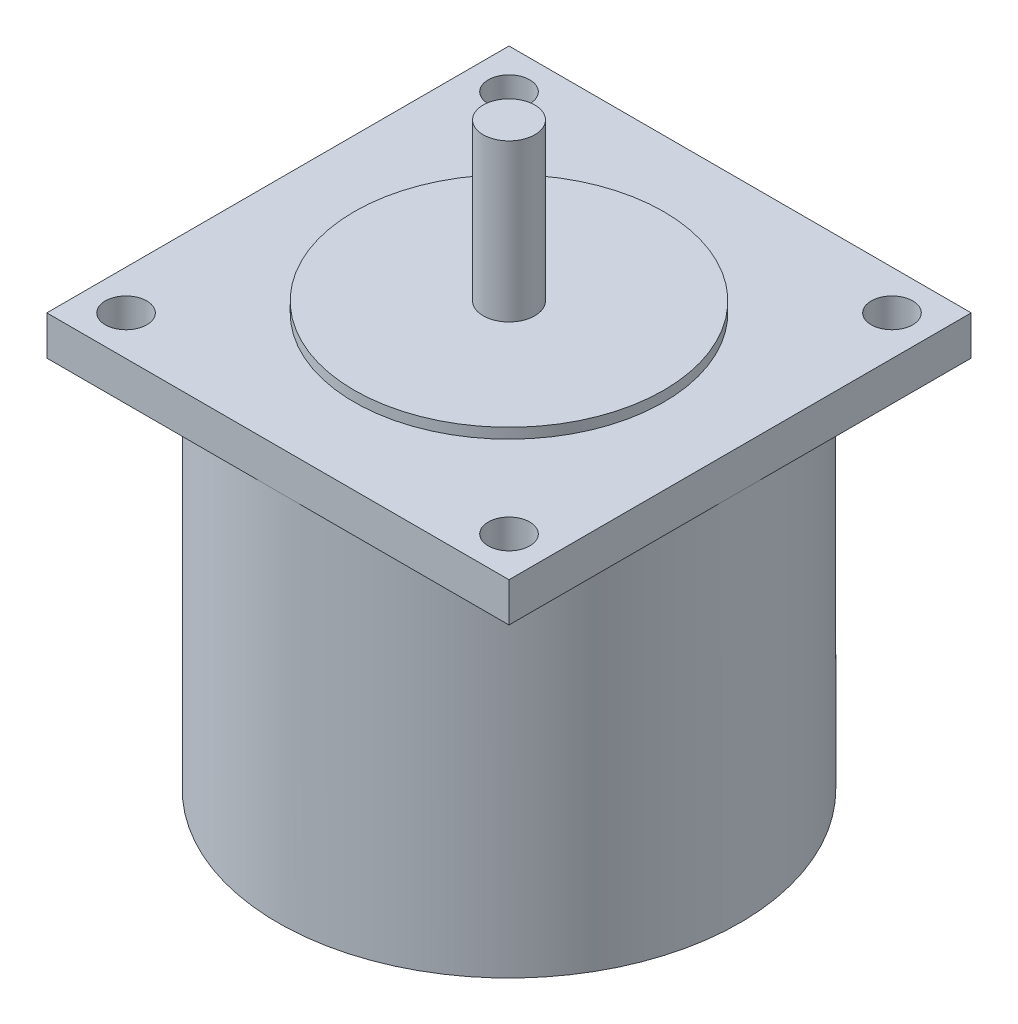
from build123d import *

# Parameters (mm, degrees)
SKETCH1_W                  = 56.896
SKETCH1_H                  = 56.896
EXTRUDE1_DEPTH             = 4.826
SKETCH2_R                  = 28.448
EXTRUDE2_DEPTH             = 45.974
SKETCH3_R                  = 3.175
EXTRUDE3_DEPTH             = 20.574
F_10_CLEARANCE_HOLE1_D     = 5.1054
F_10_CLEARANCE_HOLE1_DEPTH = 9.144
F_10_CLEARANCE_HOLE1_TIP   = 1.533816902
SKETCH7_R                  = 19.05
EXTRUDE4_DEPTH             = 1.27


with BuildPart() as part:
    # Sketch1 → Extrude1 (new body)
    with BuildSketch(Plane(origin=(0, 0, 0), x_dir=(1, 0, 0), z_dir=(0, 1, 0))):
        with Locations((28.448, 28.448)):
            Rectangle(SKETCH1_W, SKETCH1_H)
    extrude(amount=-EXTRUDE1_DEPTH)

    # Sketch2 → Extrude2 (add)
    with BuildSketch(Plane.XZ.offset(4.826)):
        with Locations(Location((28.448, -28.448, 0), (0, 0, 270))):
            Circle(SKETCH2_R)
    extrude(amount=EXTRUDE2_DEPTH)

    # Sketch3 → Extrude3 (add)
    with BuildSketch(Plane(origin=(0, 0, 0), x_dir=(-1, 0, 0), z_dir=(0, 1, 0))):
        with Locations(Location((-28.448, -28.448, 0), (0, 0, 270))):
            Circle(SKETCH3_R)
    extrude(amount=EXTRUDE3_DEPTH)

    # 10 Clearance Hole1
    with Locations(Plane.XZ.offset(4.826)):
        with Locations((4.8768, -4.8768), (52.0192, -4.8768), (52.0192, -52.0192), (4.8768, -52.0192)):
            Hole(F_10_CLEARANCE_HOLE1_D / 2, depth=F_10_CLEARANCE_HOLE1_DEPTH)
            with Locations((0, 0, -(F_10_CLEARANCE_HOLE1_DEPTH + F_10_CLEARANCE_HOLE1_TIP / 2))):  # 118° drill point
                Cone(0, F_10_CLEARANCE_HOLE1_D / 2, F_10_CLEARANCE_HOLE1_TIP, mode=Mode.SUBTRACT)

    # Sketch7 → Extrude4 (add)
    with BuildSketch(Plane(origin=(0, 0, 0), x_dir=(-1, 0, 0), z_dir=(0, 1, 0))):
        with Locations(Location((-28.448, -28.448, 0), (0, 0, 270))):
            Circle(SKETCH7_R)
    extrude(amount=EXTRUDE4_DEPTH)


solid = part.part
